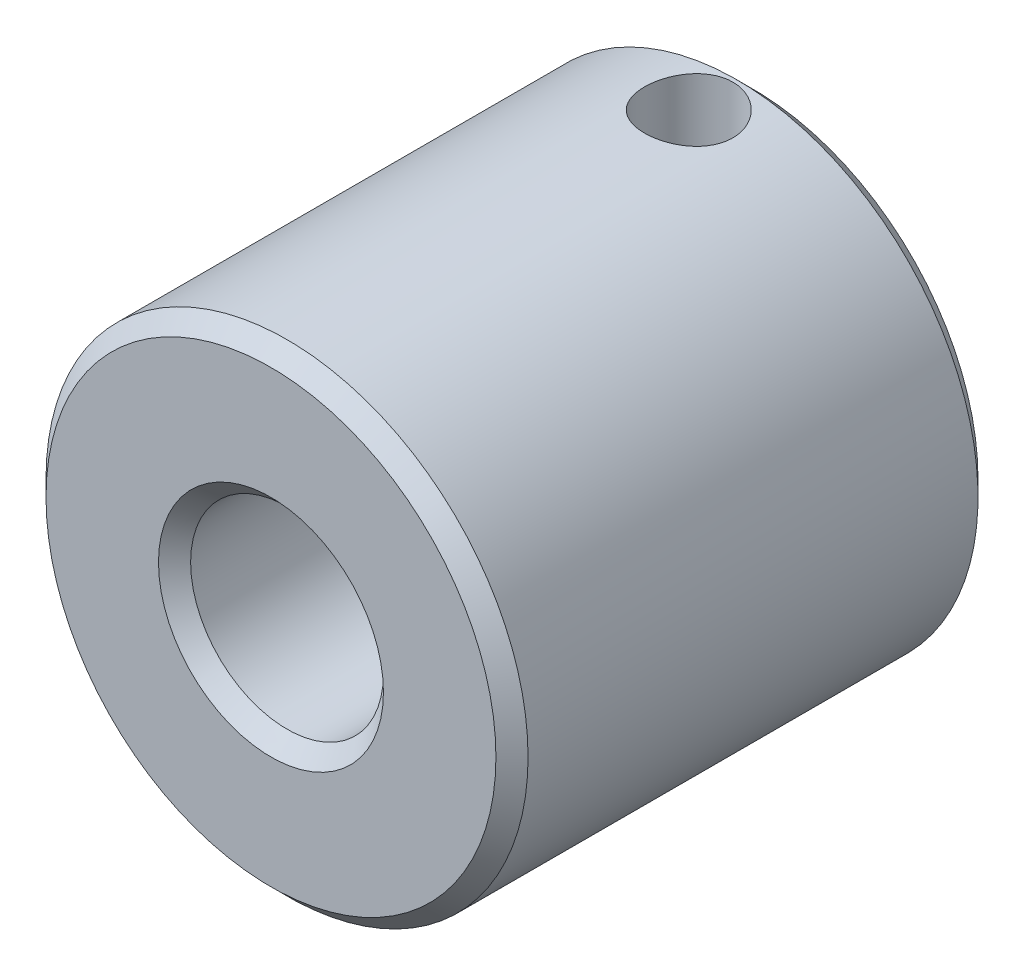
ISO-10303-21;
HEADER;
FILE_DESCRIPTION(('STEP AP214'),'2;1');
FILE_NAME('part.step','',(''),(''),'','','');
FILE_SCHEMA(('AUTOMOTIVE_DESIGN { 1 0 10303 214 1 1 1 1 }'));
ENDSEC;
DATA;
#1=APPLICATION_CONTEXT('core data for automotive mechanical design processes');
#2=APPLICATION_PROTOCOL_DEFINITION('international standard','automotive_design',2000,#1);
#3=PRODUCT_CONTEXT('',#1,'mechanical');
#4=PRODUCT('Part','Part','',(#3));
#5=PRODUCT_RELATED_PRODUCT_CATEGORY('part','',(#4));
#6=PRODUCT_DEFINITION_FORMATION('','',#4);
#7=PRODUCT_DEFINITION_CONTEXT('part definition',#1,'design');
#8=PRODUCT_DEFINITION('design','',#6,#7);
#9=PRODUCT_DEFINITION_SHAPE('','',#8);
#10=(LENGTH_UNIT() NAMED_UNIT(*) SI_UNIT(.MILLI.,.METRE.));
#11=(NAMED_UNIT(*) PLANE_ANGLE_UNIT() SI_UNIT($,.RADIAN.));
#12=(NAMED_UNIT(*) SI_UNIT($,.STERADIAN.) SOLID_ANGLE_UNIT());
#13=UNCERTAINTY_MEASURE_WITH_UNIT(LENGTH_MEASURE(1.E-05),#10,'distance_accuracy_value','');
#14=(GEOMETRIC_REPRESENTATION_CONTEXT(3) GLOBAL_UNCERTAINTY_ASSIGNED_CONTEXT((#13)) GLOBAL_UNIT_ASSIGNED_CONTEXT((#10,
#11,#12)) REPRESENTATION_CONTEXT('',''));
#15=CARTESIAN_POINT('',(0.,0.,0.));
#16=DIRECTION('',(0.,0.,1.));
#17=DIRECTION('',(1.,0.,0.));
#18=AXIS2_PLACEMENT_3D('',#15,#16,#17);
#19=CARTESIAN_POINT('',(0.,15.,4.));
#20=DIRECTION('',(0.,-1.,0.));
#21=DIRECTION('',(0.,0.,-1.));
#22=AXIS2_PLACEMENT_3D('',#19,#20,#21);
#23=CYLINDRICAL_SURFACE('',#22,2.75);
#24=CARTESIAN_POINT('',(0.,6.,6.75));
#25=CARTESIAN_POINT('',(-0.146117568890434,5.99999180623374,6.74998986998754));
#26=CARTESIAN_POINT('',(-0.292345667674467,5.99460717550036,6.73829467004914));
#27=CARTESIAN_POINT('',(-0.580460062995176,5.97360949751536,6.6920101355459));
#28=CARTESIAN_POINT('',(-0.722340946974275,5.95798420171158,6.6573933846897));
#29=CARTESIAN_POINT('',(-0.997299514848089,5.91816150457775,6.56686128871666));
#30=CARTESIAN_POINT('',(-1.13040406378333,5.89399185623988,6.51101485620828));
#31=CARTESIAN_POINT('',(-1.38523643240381,5.83936030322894,6.3799516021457));
#32=CARTESIAN_POINT('',(-1.50696344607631,5.8088979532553,6.30473340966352));
#33=CARTESIAN_POINT('',(-1.74282941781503,5.74267713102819,6.13248459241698));
#34=CARTESIAN_POINT('',(-1.85622144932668,5.70672324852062,6.03450728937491));
#35=CARTESIAN_POINT('',(-2.06562585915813,5.63431346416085,5.82154168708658));
#36=CARTESIAN_POINT('',(-2.16162818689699,5.59785728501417,5.70654361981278));
#37=CARTESIAN_POINT('',(-2.33949728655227,5.5259866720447,5.45414541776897));
#38=CARTESIAN_POINT('',(-2.4201089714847,5.49077902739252,5.31579540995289));
#39=CARTESIAN_POINT('',(-2.55658783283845,5.42858399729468,5.02567612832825));
#40=CARTESIAN_POINT('',(-2.61247010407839,5.40159160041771,4.87391510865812));
#41=CARTESIAN_POINT('',(-2.69465761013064,5.36104743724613,4.56985604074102));
#42=CARTESIAN_POINT('',(-2.72241292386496,5.34684149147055,4.41804102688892));
#43=CARTESIAN_POINT('',(-2.75205526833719,5.33165081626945,4.11129636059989));
#44=CARTESIAN_POINT('',(-2.75396127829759,5.33065638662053,3.95636907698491));
#45=CARTESIAN_POINT('',(-2.7329271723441,5.3414598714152,3.66380368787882));
#46=CARTESIAN_POINT('',(-2.7123659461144,5.35203310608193,3.52593937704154));
#47=CARTESIAN_POINT('',(-2.65103455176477,5.38267392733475,3.25589187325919));
#48=CARTESIAN_POINT('',(-2.61025945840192,5.40274382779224,3.12371007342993));
#49=CARTESIAN_POINT('',(-2.50885216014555,5.45058270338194,2.86514431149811));
#50=CARTESIAN_POINT('',(-2.44778691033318,5.47851734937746,2.73896223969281));
#51=CARTESIAN_POINT('',(-2.30785214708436,5.5389187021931,2.49808695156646));
#52=CARTESIAN_POINT('',(-2.22897546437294,5.5713872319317,2.38339838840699));
#53=CARTESIAN_POINT('',(-2.04603015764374,5.64130271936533,2.15617779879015));
#54=CARTESIAN_POINT('',(-1.94019303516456,5.67891591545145,2.04511547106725));
#55=CARTESIAN_POINT('',(-1.71111940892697,5.7520909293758,1.84174491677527));
#56=CARTESIAN_POINT('',(-1.58787303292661,5.78765156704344,1.74944740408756));
#57=CARTESIAN_POINT('',(-1.32201075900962,5.85419497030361,1.58336943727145));
#58=CARTESIAN_POINT('',(-1.1788811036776,5.88498246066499,1.51032001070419));
#59=CARTESIAN_POINT('',(-0.955450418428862,5.9239235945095,1.42006067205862));
#60=CARTESIAN_POINT('',(-0.87954443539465,5.93569455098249,1.39319913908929));
#61=CARTESIAN_POINT('',(-0.725336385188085,5.9565027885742,1.34615854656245));
#62=CARTESIAN_POINT('',(-0.647035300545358,5.96554117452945,1.32597678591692));
#63=CARTESIAN_POINT('',(-0.474840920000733,5.98190973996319,1.28963917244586));
#64=CARTESIAN_POINT('',(-0.380610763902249,5.98866674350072,1.27480009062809));
#65=CARTESIAN_POINT('',(-0.190936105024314,5.99771445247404,1.25497741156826));
#66=CARTESIAN_POINT('',(-0.0954916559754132,6.00000535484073,1.2499933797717));
#67=CARTESIAN_POINT('',(0.146117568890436,5.99999180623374,1.25001013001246));
#68=CARTESIAN_POINT('',(0.292345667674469,5.99460717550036,1.26170532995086));
#69=CARTESIAN_POINT('',(0.580460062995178,5.97360949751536,1.3079898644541));
#70=CARTESIAN_POINT('',(0.722340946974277,5.95798420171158,1.3426066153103));
#71=CARTESIAN_POINT('',(0.997299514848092,5.91816150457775,1.43313871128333));
#72=CARTESIAN_POINT('',(1.13040406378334,5.89399185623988,1.48898514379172));
#73=CARTESIAN_POINT('',(1.38523643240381,5.83936030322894,1.62004839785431));
#74=CARTESIAN_POINT('',(1.50696344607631,5.80889795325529,1.69526659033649));
#75=CARTESIAN_POINT('',(1.74282941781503,5.74267713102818,1.86751540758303));
#76=CARTESIAN_POINT('',(1.85622144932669,5.70672324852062,1.96549271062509));
#77=CARTESIAN_POINT('',(2.06562585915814,5.63431346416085,2.17845831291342));
#78=CARTESIAN_POINT('',(2.16162818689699,5.59785728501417,2.29345638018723));
#79=CARTESIAN_POINT('',(2.33949728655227,5.5259866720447,2.54585458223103));
#80=CARTESIAN_POINT('',(2.4201089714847,5.49077902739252,2.68420459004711));
#81=CARTESIAN_POINT('',(2.55658783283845,5.42858399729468,2.97432387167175));
#82=CARTESIAN_POINT('',(2.61247010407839,5.40159160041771,3.12608489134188));
#83=CARTESIAN_POINT('',(2.69465761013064,5.36104743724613,3.43014395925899));
#84=CARTESIAN_POINT('',(2.72241292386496,5.34684149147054,3.58195897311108));
#85=CARTESIAN_POINT('',(2.75205526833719,5.33165081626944,3.88870363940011));
#86=CARTESIAN_POINT('',(2.75396127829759,5.33065638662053,4.0436309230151));
#87=CARTESIAN_POINT('',(2.73292717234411,5.3414598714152,4.33619631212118));
#88=CARTESIAN_POINT('',(2.7123659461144,5.35203310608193,4.47406062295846));
#89=CARTESIAN_POINT('',(2.65103455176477,5.38267392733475,4.74410812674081));
#90=CARTESIAN_POINT('',(2.61025945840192,5.40274382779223,4.87628992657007));
#91=CARTESIAN_POINT('',(2.50885216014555,5.45058270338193,5.13485568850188));
#92=CARTESIAN_POINT('',(2.44778691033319,5.47851734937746,5.26103776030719));
#93=CARTESIAN_POINT('',(2.30785214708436,5.5389187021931,5.50191304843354));
#94=CARTESIAN_POINT('',(2.22897546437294,5.5713872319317,5.616601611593));
#95=CARTESIAN_POINT('',(2.04603015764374,5.64130271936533,5.84382220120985));
#96=CARTESIAN_POINT('',(1.94019303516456,5.67891591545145,5.95488452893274));
#97=CARTESIAN_POINT('',(1.71111940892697,5.7520909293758,6.15825508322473));
#98=CARTESIAN_POINT('',(1.58787303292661,5.78765156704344,6.25055259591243));
#99=CARTESIAN_POINT('',(1.32201075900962,5.85419497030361,6.41663056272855));
#100=CARTESIAN_POINT('',(1.1788811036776,5.88498246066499,6.48967998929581));
#101=CARTESIAN_POINT('',(0.955450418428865,5.9239235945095,6.57993932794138));
#102=CARTESIAN_POINT('',(0.879544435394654,5.93569455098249,6.60680086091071));
#103=CARTESIAN_POINT('',(0.725336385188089,5.9565027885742,6.65384145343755));
#104=CARTESIAN_POINT('',(0.647035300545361,5.96554117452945,6.67402321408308));
#105=CARTESIAN_POINT('',(0.474840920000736,5.98190973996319,6.71036082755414));
#106=CARTESIAN_POINT('',(0.380610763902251,5.98866674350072,6.72519990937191));
#107=CARTESIAN_POINT('',(0.190936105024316,5.99771445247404,6.74502258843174));
#108=CARTESIAN_POINT('',(0.0954916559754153,6.00000535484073,6.7500066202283));
#109=CARTESIAN_POINT('',(0.,6.,6.75));
#110=B_SPLINE_CURVE_WITH_KNOTS('',3,(#24,#25,#26,#27,#28,#29,#30,#31,#32,#33,#34,#35,#36,#37,
#38,#39,#40,#41,#42,#43,#44,#45,#46,#47,#48,#49,#50,#51,#52,#53,#54,#55,#56,#57,#58,#59,#60,#61,
#62,#63,#64,#65,#66,#67,#68,#69,#70,#71,#72,#73,#74,#75,#76,#77,#78,#79,#80,#81,#82,#83,#84,#85,
#86,#87,#88,#89,#90,#91,#92,#93,#94,#95,#96,#97,#98,#99,#100,#101,#102,#103,#104,#105,#106,#107,
#108,#109),.UNSPECIFIED.,.T.,.F.,(4,2,2,2,2,2,2,2,2,2,2,2,2,2,2,2,2,2,2,2,2,2,2,2,2,2,2,2,2,2,2,
2,2,2,2,2,2,2,2,2,2,2,4),(0.,0.437993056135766,0.876510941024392,1.31361736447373,
1.7507547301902,2.21112066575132,2.67175183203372,3.16111259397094,3.65017423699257,
4.1124963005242,4.57447889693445,4.99189927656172,5.40942141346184,5.83649784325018,
6.26374648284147,6.73551017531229,7.20754247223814,7.69552386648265,7.9393509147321,
8.18307924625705,8.46933179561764,8.75557172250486,9.19356477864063,9.63208266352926,
10.0691890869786,10.5063264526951,10.9666923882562,11.4273235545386,11.9166843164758,
12.4057459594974,12.8680680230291,13.3300506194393,13.7474709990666,14.1649931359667,
14.592069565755,15.0193182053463,15.4910818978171,15.963114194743,16.4510955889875,
16.694922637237,16.9386509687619,17.2249035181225,17.5111434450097),.UNSPECIFIED.);
#111=CARTESIAN_POINT('',(0.,6.,6.75));
#112=VERTEX_POINT('',#111);
#113=EDGE_CURVE('E45',#112,#112,#110,.T.);
#114=ORIENTED_EDGE('',*,*,#113,.T.);
#115=EDGE_LOOP('',(#114));
#116=FACE_BOUND('',#115,.T.);
#117=CARTESIAN_POINT('',(0.,15.,6.75));
#118=CARTESIAN_POINT('',(-0.152939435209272,14.9999967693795,6.74999281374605));
#119=CARTESIAN_POINT('',(-0.306071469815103,14.997634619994,6.7371870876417));
#120=CARTESIAN_POINT('',(-0.608143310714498,14.9884323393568,6.68629994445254));
#121=CARTESIAN_POINT('',(-0.757074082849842,14.9815832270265,6.64816783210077));
#122=CARTESIAN_POINT('',(-1.04615408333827,14.9641738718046,6.54782757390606));
#123=CARTESIAN_POINT('',(-1.18631467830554,14.9536185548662,6.48565137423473));
#124=CARTESIAN_POINT('',(-1.45415890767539,14.9299538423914,6.33906615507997));
#125=CARTESIAN_POINT('',(-1.58184691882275,14.9168453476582,6.25466497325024));
#126=CARTESIAN_POINT('',(-1.82266162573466,14.889350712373,6.06497899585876));
#127=CARTESIAN_POINT('',(-1.9356233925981,14.8749527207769,5.95948649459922));
#128=CARTESIAN_POINT('',(-2.14235500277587,14.8465898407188,5.73105441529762));
#129=CARTESIAN_POINT('',(-2.23612249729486,14.8326250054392,5.60811270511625));
#130=CARTESIAN_POINT('',(-2.40246884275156,14.8065968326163,5.34713206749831));
#131=CARTESIAN_POINT('',(-2.4748830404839,14.7945485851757,5.2089865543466));
#132=CARTESIAN_POINT('',(-2.59541249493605,14.7738822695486,4.92223450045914));
#133=CARTESIAN_POINT('',(-2.64352995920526,14.7652638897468,4.77362891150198));
#134=CARTESIAN_POINT('',(-2.71357913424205,14.7525507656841,4.47191721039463));
#135=CARTESIAN_POINT('',(-2.73579492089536,14.7484069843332,4.31887915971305));
#136=CARTESIAN_POINT('',(-2.75429165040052,14.7449642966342,4.01119574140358));
#137=CARTESIAN_POINT('',(-2.75057477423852,14.7456649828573,3.85655051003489));
#138=CARTESIAN_POINT('',(-2.71754232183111,14.751787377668,3.55209589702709));
#139=CARTESIAN_POINT('',(-2.68854917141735,14.7571496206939,3.40225016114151));
#140=CARTESIAN_POINT('',(-2.60629417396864,14.7718976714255,3.10958521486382));
#141=CARTESIAN_POINT('',(-2.55303114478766,14.7812836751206,2.96676634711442));
#142=CARTESIAN_POINT('',(-2.42342864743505,14.8030846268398,2.69125826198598));
#143=CARTESIAN_POINT('',(-2.34695749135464,14.815516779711,2.55863241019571));
#144=CARTESIAN_POINT('',(-2.17320882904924,14.8419965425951,2.30798340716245));
#145=CARTESIAN_POINT('',(-2.07593087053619,14.8560441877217,2.18996057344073));
#146=CARTESIAN_POINT('',(-1.86160679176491,14.8844299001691,1.97001308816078));
#147=CARTESIAN_POINT('',(-1.74428821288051,14.8987691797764,1.86835393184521));
#148=CARTESIAN_POINT('',(-1.4940603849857,14.9259369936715,1.68607542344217));
#149=CARTESIAN_POINT('',(-1.36114426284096,14.9387648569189,1.60546539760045));
#150=CARTESIAN_POINT('',(-1.08318739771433,14.9614900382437,1.46754334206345));
#151=CARTESIAN_POINT('',(-0.938123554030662,14.9713816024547,1.41027697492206));
#152=CARTESIAN_POINT('',(-0.640402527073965,14.9870605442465,1.32111261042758));
#153=CARTESIAN_POINT('',(-0.487762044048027,14.9928565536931,1.28916124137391));
#154=CARTESIAN_POINT('',(-0.278324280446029,14.9975209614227,1.26354988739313));
#155=CARTESIAN_POINT('',(-0.222792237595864,14.9984485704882,1.2584728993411));
#156=CARTESIAN_POINT('',(-0.111515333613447,14.999688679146,1.25169664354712));
#157=CARTESIAN_POINT('',(-0.0557704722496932,15.0000011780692,1.24999737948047));
#158=CARTESIAN_POINT('',(0.152939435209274,14.9999967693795,1.25000718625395));
#159=CARTESIAN_POINT('',(0.306071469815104,14.997634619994,1.2628129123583));
#160=CARTESIAN_POINT('',(0.6081433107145,14.9884323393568,1.31370005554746));
#161=CARTESIAN_POINT('',(0.757074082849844,14.9815832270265,1.35183216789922));
#162=CARTESIAN_POINT('',(1.04615408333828,14.9641738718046,1.45217242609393));
#163=CARTESIAN_POINT('',(1.18631467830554,14.9536185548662,1.51434862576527));
#164=CARTESIAN_POINT('',(1.45415890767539,14.9299538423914,1.66093384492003));
#165=CARTESIAN_POINT('',(1.58184691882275,14.9168453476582,1.74533502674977));
#166=CARTESIAN_POINT('',(1.82266162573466,14.889350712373,1.93502100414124));
#167=CARTESIAN_POINT('',(1.9356233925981,14.8749527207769,2.04051350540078));
#168=CARTESIAN_POINT('',(2.14235500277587,14.8465898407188,2.26894558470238));
#169=CARTESIAN_POINT('',(2.23612249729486,14.8326250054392,2.39188729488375));
#170=CARTESIAN_POINT('',(2.40246884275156,14.8065968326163,2.65286793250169));
#171=CARTESIAN_POINT('',(2.4748830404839,14.7945485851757,2.7910134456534));
#172=CARTESIAN_POINT('',(2.59541249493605,14.7738822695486,3.07776549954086));
#173=CARTESIAN_POINT('',(2.64352995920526,14.7652638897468,3.22637108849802));
#174=CARTESIAN_POINT('',(2.71357913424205,14.7525507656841,3.52808278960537));
#175=CARTESIAN_POINT('',(2.73579492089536,14.7484069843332,3.68112084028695));
#176=CARTESIAN_POINT('',(2.75429165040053,14.7449642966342,3.98880425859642));
#177=CARTESIAN_POINT('',(2.75057477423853,14.7456649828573,4.14344948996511));
#178=CARTESIAN_POINT('',(2.71754232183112,14.751787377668,4.44790410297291));
#179=CARTESIAN_POINT('',(2.68854917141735,14.7571496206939,4.59774983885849));
#180=CARTESIAN_POINT('',(2.60629417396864,14.7718976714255,4.89041478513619));
#181=CARTESIAN_POINT('',(2.55303114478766,14.7812836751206,5.03323365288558));
#182=CARTESIAN_POINT('',(2.42342864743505,14.8030846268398,5.30874173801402));
#183=CARTESIAN_POINT('',(2.34695749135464,14.815516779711,5.44136758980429));
#184=CARTESIAN_POINT('',(2.17320882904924,14.8419965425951,5.69201659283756));
#185=CARTESIAN_POINT('',(2.07593087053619,14.8560441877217,5.81003942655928));
#186=CARTESIAN_POINT('',(1.86160679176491,14.8844299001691,6.02998691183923));
#187=CARTESIAN_POINT('',(1.74428821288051,14.8987691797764,6.13164606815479));
#188=CARTESIAN_POINT('',(1.4940603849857,14.9259369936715,6.31392457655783));
#189=CARTESIAN_POINT('',(1.36114426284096,14.9387648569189,6.39453460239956));
#190=CARTESIAN_POINT('',(1.08318739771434,14.9614900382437,6.53245665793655));
#191=CARTESIAN_POINT('',(0.938123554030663,14.9713816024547,6.58972302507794));
#192=CARTESIAN_POINT('',(0.640402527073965,14.9870605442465,6.67888738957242));
#193=CARTESIAN_POINT('',(0.487762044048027,14.9928565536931,6.71083875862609));
#194=CARTESIAN_POINT('',(0.27832428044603,14.9975209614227,6.73645011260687));
#195=CARTESIAN_POINT('',(0.222792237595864,14.9984485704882,6.7415271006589));
#196=CARTESIAN_POINT('',(0.111515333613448,14.999688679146,6.74830335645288));
#197=CARTESIAN_POINT('',(0.055770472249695,15.0000011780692,6.75000262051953));
#198=CARTESIAN_POINT('',(0.,15.,6.75));
#199=B_SPLINE_CURVE_WITH_KNOTS('',3,(#117,#118,#119,#120,#121,#122,#123,#124,#125,#126,#127,
#128,#129,#130,#131,#132,#133,#134,#135,#136,#137,#138,#139,#140,#141,#142,#143,#144,#145,#146,
#147,#148,#149,#150,#151,#152,#153,#154,#155,#156,#157,#158,#159,#160,#161,#162,#163,#164,#165,
#166,#167,#168,#169,#170,#171,#172,#173,#174,#175,#176,#177,#178,#179,#180,#181,#182,#183,#184,
#185,#186,#187,#188,#189,#190,#191,#192,#193,#194,#195,#196,#197,#198),.UNSPECIFIED.,.T.,.F.,(4,
2,2,2,2,2,2,2,2,2,2,2,2,2,2,2,2,2,2,2,2,2,2,2,2,2,2,2,2,2,2,2,2,2,2,2,2,2,2,2,4),(0.,
0.458605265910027,0.918131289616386,1.37704885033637,1.83580478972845,2.2993232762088,
2.76289844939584,3.22995995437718,3.69697901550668,4.15882638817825,4.6206349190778,
5.07663738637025,5.53266206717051,5.99132430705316,6.44999651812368,6.91548961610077,
7.38118861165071,7.84779423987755,8.31341348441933,8.48064703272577,8.64788076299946,
9.10648602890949,9.56601205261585,10.0249296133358,10.4836855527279,10.9472040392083,
11.4107792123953,11.8778407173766,12.3448597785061,12.8067071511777,13.2685156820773,
13.7245181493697,14.18054283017,14.6392050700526,15.0978772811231,15.5633703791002,
16.0290693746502,16.495675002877,16.9612942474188,17.1285277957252,17.2957615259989),.UNSPECIFIED.);
#200=CARTESIAN_POINT('',(0.,15.,6.75));
#201=VERTEX_POINT('',#200);
#202=EDGE_CURVE('E44',#201,#201,#199,.T.);
#203=ORIENTED_EDGE('',*,*,#202,.F.);
#204=EDGE_LOOP('',(#203));
#205=FACE_BOUND('',#204,.T.);
#206=ADVANCED_FACE('F12',(#116,#205),#23,.F.);
#207=CARTESIAN_POINT('',(0.,0.,0.));
#208=DIRECTION('',(0.,0.,-1.));
#209=DIRECTION('',(-1.,0.,0.));
#210=AXIS2_PLACEMENT_3D('',#207,#208,#209);
#211=CYLINDRICAL_SURFACE('',#210,6.);
#212=CARTESIAN_POINT('',(0.,0.,1.00000000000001));
#213=DIRECTION('',(0.,0.,-1.));
#214=DIRECTION('',(-1.,0.,0.));
#215=AXIS2_PLACEMENT_3D('',#212,#213,#214);
#216=CIRCLE('',#215,6.);
#217=CARTESIAN_POINT('',(-6.,0.,1.00000000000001));
#218=VERTEX_POINT('',#217);
#219=EDGE_CURVE('E32',#218,#218,#216,.T.);
#220=ORIENTED_EDGE('',*,*,#219,.T.);
#221=EDGE_LOOP('',(#220));
#222=FACE_BOUND('',#221,.T.);
#223=CARTESIAN_POINT('',(0.,0.,29.));
#224=DIRECTION('',(0.,0.,1.));
#225=DIRECTION('',(1.,0.,0.));
#226=AXIS2_PLACEMENT_3D('',#223,#224,#225);
#227=CIRCLE('',#226,6.);
#228=CARTESIAN_POINT('',(6.,0.,29.));
#229=VERTEX_POINT('',#228);
#230=EDGE_CURVE('E35',#229,#229,#227,.T.);
#231=ORIENTED_EDGE('',*,*,#230,.T.);
#232=EDGE_LOOP('',(#231));
#233=FACE_BOUND('',#232,.T.);
#234=ORIENTED_EDGE('',*,*,#113,.F.);
#235=EDGE_LOOP('',(#234));
#236=FACE_BOUND('',#235,.T.);
#237=ADVANCED_FACE('F59',(#222,#233,#236),#211,.F.);
#238=CARTESIAN_POINT('',(0.,15.,30.));
#239=DIRECTION('',(0.,0.,1.));
#240=DIRECTION('',(1.,0.,0.));
#241=AXIS2_PLACEMENT_3D('',#238,#239,#240);
#242=PLANE('',#241);
#243=CARTESIAN_POINT('',(0.,0.,30.));
#244=DIRECTION('',(0.,0.,1.));
#245=DIRECTION('',(1.,0.,0.));
#246=AXIS2_PLACEMENT_3D('',#243,#244,#245);
#247=CIRCLE('',#246,14.);
#248=CARTESIAN_POINT('',(14.,0.,30.));
#249=VERTEX_POINT('',#248);
#250=EDGE_CURVE('E8',#249,#249,#247,.T.);
#251=ORIENTED_EDGE('',*,*,#250,.T.);
#252=EDGE_LOOP('',(#251));
#253=FACE_BOUND('',#252,.T.);
#254=CARTESIAN_POINT('',(0.,0.,30.));
#255=DIRECTION('',(0.,0.,1.));
#256=DIRECTION('',(1.,0.,0.));
#257=AXIS2_PLACEMENT_3D('',#254,#255,#256);
#258=CIRCLE('',#257,7.);
#259=CARTESIAN_POINT('',(7.,0.,30.));
#260=VERTEX_POINT('',#259);
#261=EDGE_CURVE('E19',#260,#260,#258,.F.);
#262=ORIENTED_EDGE('',*,*,#261,.T.);
#263=EDGE_LOOP('',(#262));
#264=FACE_BOUND('',#263,.T.);
#265=ADVANCED_FACE('F63',(#253,#264),#242,.T.);
#266=CARTESIAN_POINT('',(0.,15.,0.));
#267=DIRECTION('',(0.,0.,-1.));
#268=DIRECTION('',(-1.,0.,0.));
#269=AXIS2_PLACEMENT_3D('',#266,#267,#268);
#270=PLANE('',#269);
#271=CARTESIAN_POINT('',(0.,0.,0.));
#272=DIRECTION('',(0.,0.,-1.));
#273=DIRECTION('',(-1.,0.,0.));
#274=AXIS2_PLACEMENT_3D('',#271,#272,#273);
#275=CIRCLE('',#274,7.);
#276=CARTESIAN_POINT('',(-7.,0.,0.));
#277=VERTEX_POINT('',#276);
#278=EDGE_CURVE('E38',#277,#277,#275,.F.);
#279=ORIENTED_EDGE('',*,*,#278,.T.);
#280=EDGE_LOOP('',(#279));
#281=FACE_BOUND('',#280,.T.);
#282=CARTESIAN_POINT('',(0.,0.,0.));
#283=DIRECTION('',(0.,0.,-1.));
#284=DIRECTION('',(-1.,0.,0.));
#285=AXIS2_PLACEMENT_3D('',#282,#283,#284);
#286=CIRCLE('',#285,14.);
#287=CARTESIAN_POINT('',(-14.,0.,0.));
#288=VERTEX_POINT('',#287);
#289=EDGE_CURVE('E41',#288,#288,#286,.T.);
#290=ORIENTED_EDGE('',*,*,#289,.T.);
#291=EDGE_LOOP('',(#290));
#292=FACE_BOUND('',#291,.T.);
#293=ADVANCED_FACE('F67',(#281,#292),#270,.T.);
#294=CARTESIAN_POINT('',(0.,0.,0.));
#295=DIRECTION('',(0.,0.,-1.));
#296=DIRECTION('',(-1.,0.,0.));
#297=AXIS2_PLACEMENT_3D('',#294,#295,#296);
#298=CYLINDRICAL_SURFACE('',#297,15.);
#299=CARTESIAN_POINT('',(0.,0.,1.));
#300=DIRECTION('',(0.,0.,-1.));
#301=DIRECTION('',(-1.,0.,0.));
#302=AXIS2_PLACEMENT_3D('',#299,#300,#301);
#303=CIRCLE('',#302,15.);
#304=CARTESIAN_POINT('',(-15.,0.,1.));
#305=VERTEX_POINT('',#304);
#306=EDGE_CURVE('E23',#305,#305,#303,.F.);
#307=ORIENTED_EDGE('',*,*,#306,.T.);
#308=EDGE_LOOP('',(#307));
#309=FACE_BOUND('',#308,.T.);
#310=CARTESIAN_POINT('',(0.,0.,29.));
#311=DIRECTION('',(0.,0.,1.));
#312=DIRECTION('',(1.,0.,0.));
#313=AXIS2_PLACEMENT_3D('',#310,#311,#312);
#314=CIRCLE('',#313,15.);
#315=CARTESIAN_POINT('',(15.,0.,29.));
#316=VERTEX_POINT('',#315);
#317=EDGE_CURVE('E27',#316,#316,#314,.F.);
#318=ORIENTED_EDGE('',*,*,#317,.T.);
#319=EDGE_LOOP('',(#318));
#320=FACE_BOUND('',#319,.T.);
#321=ORIENTED_EDGE('',*,*,#202,.T.);
#322=EDGE_LOOP('',(#321));
#323=FACE_BOUND('',#322,.T.);
#324=ADVANCED_FACE('F69',(#309,#320,#323),#298,.T.);
#325=CARTESIAN_POINT('',(0.,0.,0.));
#326=DIRECTION('',(0.,0.,-1.));
#327=DIRECTION('',(-1.,0.,0.));
#328=AXIS2_PLACEMENT_3D('',#325,#326,#327);
#329=CONICAL_SURFACE('',#328,7.,0.785398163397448);
#330=ORIENTED_EDGE('',*,*,#219,.F.);
#331=EDGE_LOOP('',(#330));
#332=FACE_BOUND('',#331,.T.);
#333=ORIENTED_EDGE('',*,*,#278,.F.);
#334=EDGE_LOOP('',(#333));
#335=FACE_BOUND('',#334,.T.);
#336=ADVANCED_FACE('F73',(#332,#335),#329,.F.);
#337=CARTESIAN_POINT('',(0.,0.,1.));
#338=DIRECTION('',(0.,0.,1.));
#339=DIRECTION('',(1.,0.,0.));
#340=AXIS2_PLACEMENT_3D('',#337,#338,#339);
#341=CONICAL_SURFACE('',#340,15.,0.785398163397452);
#342=ORIENTED_EDGE('',*,*,#289,.F.);
#343=EDGE_LOOP('',(#342));
#344=FACE_BOUND('',#343,.T.);
#345=ORIENTED_EDGE('',*,*,#306,.F.);
#346=EDGE_LOOP('',(#345));
#347=FACE_BOUND('',#346,.T.);
#348=ADVANCED_FACE('F80',(#344,#347),#341,.T.);
#349=CARTESIAN_POINT('',(0.,0.,29.));
#350=DIRECTION('',(0.,0.,-1.));
#351=DIRECTION('',(-1.,0.,0.));
#352=AXIS2_PLACEMENT_3D('',#349,#350,#351);
#353=CONICAL_SURFACE('',#352,15.,0.785398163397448);
#354=ORIENTED_EDGE('',*,*,#250,.F.);
#355=EDGE_LOOP('',(#354));
#356=FACE_BOUND('',#355,.T.);
#357=ORIENTED_EDGE('',*,*,#317,.F.);
#358=EDGE_LOOP('',(#357));
#359=FACE_BOUND('',#358,.T.);
#360=ADVANCED_FACE('F135',(#356,#359),#353,.T.);
#361=CARTESIAN_POINT('',(0.,0.,30.));
#362=DIRECTION('',(0.,0.,1.));
#363=DIRECTION('',(1.,0.,0.));
#364=AXIS2_PLACEMENT_3D('',#361,#362,#363);
#365=CONICAL_SURFACE('',#364,7.,0.785398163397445);
#366=ORIENTED_EDGE('',*,*,#230,.F.);
#367=EDGE_LOOP('',(#366));
#368=FACE_BOUND('',#367,.T.);
#369=ORIENTED_EDGE('',*,*,#261,.F.);
#370=EDGE_LOOP('',(#369));
#371=FACE_BOUND('',#370,.T.);
#372=ADVANCED_FACE('F14',(#368,#371),#365,.F.);
#373=CLOSED_SHELL('',(#206,#237,#265,#293,#324,#336,#348,#360,#372));
#374=MANIFOLD_SOLID_BREP('B1',#373);
#375=ADVANCED_BREP_SHAPE_REPRESENTATION('',(#18,#374),#14);
#376=SHAPE_DEFINITION_REPRESENTATION(#9,#375);
ENDSEC;
END-ISO-10303-21;
